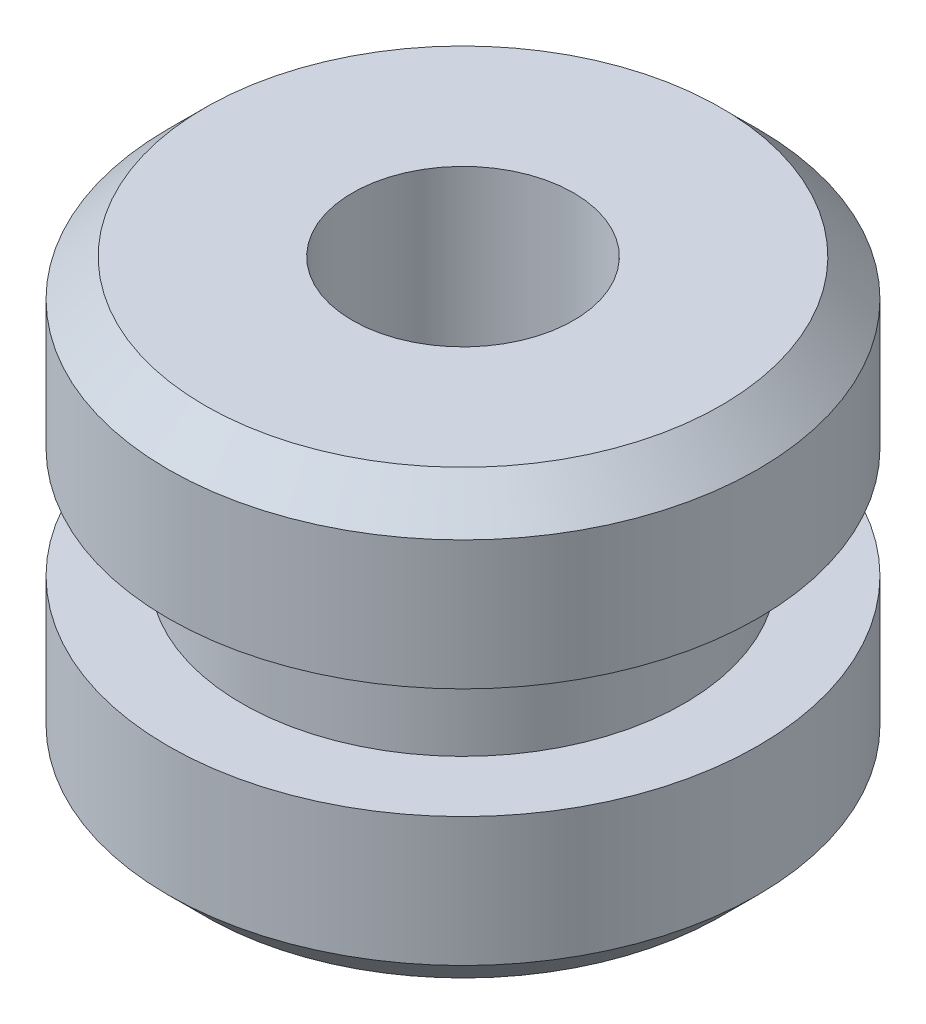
ISO-10303-21;
HEADER;
FILE_DESCRIPTION(('STEP AP214'),'2;1');
FILE_NAME('part.step','',(''),(''),'','','');
FILE_SCHEMA(('AUTOMOTIVE_DESIGN { 1 0 10303 214 1 1 1 1 }'));
ENDSEC;
DATA;
#1=APPLICATION_CONTEXT('core data for automotive mechanical design processes');
#2=APPLICATION_PROTOCOL_DEFINITION('international standard','automotive_design',2000,#1);
#3=PRODUCT_CONTEXT('',#1,'mechanical');
#4=PRODUCT('Part','Part','',(#3));
#5=PRODUCT_RELATED_PRODUCT_CATEGORY('part','',(#4));
#6=PRODUCT_DEFINITION_FORMATION('','',#4);
#7=PRODUCT_DEFINITION_CONTEXT('part definition',#1,'design');
#8=PRODUCT_DEFINITION('design','',#6,#7);
#9=PRODUCT_DEFINITION_SHAPE('','',#8);
#10=(LENGTH_UNIT() NAMED_UNIT(*) SI_UNIT(.MILLI.,.METRE.));
#11=(NAMED_UNIT(*) PLANE_ANGLE_UNIT() SI_UNIT($,.RADIAN.));
#12=(NAMED_UNIT(*) SI_UNIT($,.STERADIAN.) SOLID_ANGLE_UNIT());
#13=UNCERTAINTY_MEASURE_WITH_UNIT(LENGTH_MEASURE(1.E-05),#10,'distance_accuracy_value','');
#14=(GEOMETRIC_REPRESENTATION_CONTEXT(3) GLOBAL_UNCERTAINTY_ASSIGNED_CONTEXT((#13)) GLOBAL_UNIT_ASSIGNED_CONTEXT((#10,
#11,#12)) REPRESENTATION_CONTEXT('',''));
#15=CARTESIAN_POINT('',(0.,0.,0.));
#16=DIRECTION('',(0.,0.,1.));
#17=DIRECTION('',(1.,0.,0.));
#18=AXIS2_PLACEMENT_3D('',#15,#16,#17);
#19=CARTESIAN_POINT('',(1.5,6.,0.));
#20=DIRECTION('',(0.,1.,0.));
#21=DIRECTION('',(0.,0.,1.));
#22=AXIS2_PLACEMENT_3D('',#19,#20,#21);
#23=PLANE('',#22);
#24=CARTESIAN_POINT('',(0.,6.,0.));
#25=DIRECTION('',(0.,1.,0.));
#26=DIRECTION('',(0.,0.,1.));
#27=AXIS2_PLACEMENT_3D('',#24,#25,#26);
#28=CIRCLE('',#27,3.5);
#29=CARTESIAN_POINT('',(0.,6.,3.5));
#30=VERTEX_POINT('',#29);
#31=EDGE_CURVE('E39',#30,#30,#28,.T.);
#32=ORIENTED_EDGE('',*,*,#31,.T.);
#33=EDGE_LOOP('',(#32));
#34=FACE_BOUND('',#33,.T.);
#35=CARTESIAN_POINT('',(0.,6.,0.));
#36=DIRECTION('',(0.,-1.,0.));
#37=DIRECTION('',(0.,0.,-1.));
#38=AXIS2_PLACEMENT_3D('',#35,#36,#37);
#39=CIRCLE('',#38,1.5);
#40=CARTESIAN_POINT('',(0.,6.,-1.5));
#41=VERTEX_POINT('',#40);
#42=EDGE_CURVE('E63',#41,#41,#39,.T.);
#43=ORIENTED_EDGE('',*,*,#42,.T.);
#44=EDGE_LOOP('',(#43));
#45=FACE_BOUND('',#44,.T.);
#46=ADVANCED_FACE('F29',(#34,#45),#23,.T.);
#47=CARTESIAN_POINT('',(0.,-8.,0.));
#48=DIRECTION('',(0.,-1.,0.));
#49=DIRECTION('',(0.,0.,-1.));
#50=AXIS2_PLACEMENT_3D('',#47,#48,#49);
#51=CYLINDRICAL_SURFACE('',#50,4.);
#52=CARTESIAN_POINT('',(0.,5.49999999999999,0.));
#53=DIRECTION('',(0.,1.,0.));
#54=DIRECTION('',(0.,0.,1.));
#55=AXIS2_PLACEMENT_3D('',#52,#53,#54);
#56=CIRCLE('',#55,4.);
#57=CARTESIAN_POINT('',(0.,5.49999999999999,4.));
#58=VERTEX_POINT('',#57);
#59=EDGE_CURVE('E43',#58,#58,#56,.F.);
#60=ORIENTED_EDGE('',*,*,#59,.T.);
#61=EDGE_LOOP('',(#60));
#62=FACE_BOUND('',#61,.T.);
#63=CARTESIAN_POINT('',(0.,3.75,0.));
#64=DIRECTION('',(0.,-1.,0.));
#65=DIRECTION('',(0.,0.,-1.));
#66=AXIS2_PLACEMENT_3D('',#63,#64,#65);
#67=CIRCLE('',#66,4.);
#68=CARTESIAN_POINT('',(0.,3.75,-4.));
#69=VERTEX_POINT('',#68);
#70=EDGE_CURVE('E48',#69,#69,#67,.T.);
#71=ORIENTED_EDGE('',*,*,#70,.F.);
#72=EDGE_LOOP('',(#71));
#73=FACE_BOUND('',#72,.T.);
#74=ADVANCED_FACE('F84',(#62,#73),#51,.T.);
#75=CARTESIAN_POINT('',(4.,3.75,0.));
#76=DIRECTION('',(0.,-1.,0.));
#77=DIRECTION('',(0.,0.,-1.));
#78=AXIS2_PLACEMENT_3D('',#75,#76,#77);
#79=PLANE('',#78);
#80=ORIENTED_EDGE('',*,*,#70,.T.);
#81=EDGE_LOOP('',(#80));
#82=FACE_BOUND('',#81,.T.);
#83=CARTESIAN_POINT('',(0.,3.75,0.));
#84=DIRECTION('',(0.,-1.,0.));
#85=DIRECTION('',(0.,0.,-1.));
#86=AXIS2_PLACEMENT_3D('',#83,#84,#85);
#87=CIRCLE('',#86,3.);
#88=CARTESIAN_POINT('',(0.,3.75,-3.));
#89=VERTEX_POINT('',#88);
#90=EDGE_CURVE('E51',#89,#89,#87,.T.);
#91=ORIENTED_EDGE('',*,*,#90,.F.);
#92=EDGE_LOOP('',(#91));
#93=FACE_BOUND('',#92,.T.);
#94=ADVANCED_FACE('F89',(#82,#93),#79,.T.);
#95=CARTESIAN_POINT('',(0.,-8.,0.));
#96=DIRECTION('',(0.,-1.,0.));
#97=DIRECTION('',(0.,0.,-1.));
#98=AXIS2_PLACEMENT_3D('',#95,#96,#97);
#99=CYLINDRICAL_SURFACE('',#98,3.);
#100=ORIENTED_EDGE('',*,*,#90,.T.);
#101=EDGE_LOOP('',(#100));
#102=FACE_BOUND('',#101,.T.);
#103=CARTESIAN_POINT('',(0.,2.25,0.));
#104=DIRECTION('',(0.,-1.,0.));
#105=DIRECTION('',(0.,0.,-1.));
#106=AXIS2_PLACEMENT_3D('',#103,#104,#105);
#107=CIRCLE('',#106,3.);
#108=CARTESIAN_POINT('',(0.,2.25,-3.));
#109=VERTEX_POINT('',#108);
#110=EDGE_CURVE('E54',#109,#109,#107,.T.);
#111=ORIENTED_EDGE('',*,*,#110,.F.);
#112=EDGE_LOOP('',(#111));
#113=FACE_BOUND('',#112,.T.);
#114=ADVANCED_FACE('F99',(#102,#113),#99,.T.);
#115=CARTESIAN_POINT('',(3.,2.25,0.));
#116=DIRECTION('',(0.,1.,0.));
#117=DIRECTION('',(0.,0.,1.));
#118=AXIS2_PLACEMENT_3D('',#115,#116,#117);
#119=PLANE('',#118);
#120=ORIENTED_EDGE('',*,*,#110,.T.);
#121=EDGE_LOOP('',(#120));
#122=FACE_BOUND('',#121,.T.);
#123=CARTESIAN_POINT('',(0.,2.25,0.));
#124=DIRECTION('',(0.,-1.,0.));
#125=DIRECTION('',(0.,0.,-1.));
#126=AXIS2_PLACEMENT_3D('',#123,#124,#125);
#127=CIRCLE('',#126,4.);
#128=CARTESIAN_POINT('',(0.,2.25,-4.));
#129=VERTEX_POINT('',#128);
#130=EDGE_CURVE('E57',#129,#129,#127,.T.);
#131=ORIENTED_EDGE('',*,*,#130,.F.);
#132=EDGE_LOOP('',(#131));
#133=FACE_BOUND('',#132,.T.);
#134=ADVANCED_FACE('F105',(#122,#133),#119,.T.);
#135=CARTESIAN_POINT('',(0.,-8.,0.));
#136=DIRECTION('',(0.,-1.,0.));
#137=DIRECTION('',(0.,0.,-1.));
#138=AXIS2_PLACEMENT_3D('',#135,#136,#137);
#139=CYLINDRICAL_SURFACE('',#138,4.);
#140=CARTESIAN_POINT('',(0.,0.500000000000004,0.));
#141=DIRECTION('',(0.,-1.,0.));
#142=DIRECTION('',(0.,0.,-1.));
#143=AXIS2_PLACEMENT_3D('',#140,#141,#142);
#144=CIRCLE('',#143,4.);
#145=CARTESIAN_POINT('',(0.,0.500000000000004,-4.));
#146=VERTEX_POINT('',#145);
#147=EDGE_CURVE('E10',#146,#146,#144,.F.);
#148=ORIENTED_EDGE('',*,*,#147,.T.);
#149=EDGE_LOOP('',(#148));
#150=FACE_BOUND('',#149,.T.);
#151=ORIENTED_EDGE('',*,*,#130,.T.);
#152=EDGE_LOOP('',(#151));
#153=FACE_BOUND('',#152,.T.);
#154=ADVANCED_FACE('F81',(#150,#153),#139,.T.);
#155=CARTESIAN_POINT('',(4.,0.,0.));
#156=DIRECTION('',(0.,-1.,0.));
#157=DIRECTION('',(0.,0.,-1.));
#158=AXIS2_PLACEMENT_3D('',#155,#156,#157);
#159=PLANE('',#158);
#160=CARTESIAN_POINT('',(0.,0.,0.));
#161=DIRECTION('',(0.,-1.,0.));
#162=DIRECTION('',(0.,0.,-1.));
#163=AXIS2_PLACEMENT_3D('',#160,#161,#162);
#164=CIRCLE('',#163,3.49999999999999);
#165=CARTESIAN_POINT('',(0.,0.,-3.49999999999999));
#166=VERTEX_POINT('',#165);
#167=EDGE_CURVE('E35',#166,#166,#164,.T.);
#168=ORIENTED_EDGE('',*,*,#167,.T.);
#169=EDGE_LOOP('',(#168));
#170=FACE_BOUND('',#169,.T.);
#171=CARTESIAN_POINT('',(0.,0.,0.));
#172=DIRECTION('',(0.,-1.,0.));
#173=DIRECTION('',(0.,0.,-1.));
#174=AXIS2_PLACEMENT_3D('',#171,#172,#173);
#175=CIRCLE('',#174,1.5);
#176=CARTESIAN_POINT('',(0.,0.,-1.5));
#177=VERTEX_POINT('',#176);
#178=EDGE_CURVE('E60',#177,#177,#175,.T.);
#179=ORIENTED_EDGE('',*,*,#178,.F.);
#180=EDGE_LOOP('',(#179));
#181=FACE_BOUND('',#180,.T.);
#182=ADVANCED_FACE('F71',(#170,#181),#159,.T.);
#183=CARTESIAN_POINT('',(0.,-8.,0.));
#184=DIRECTION('',(0.,-1.,0.));
#185=DIRECTION('',(0.,0.,-1.));
#186=AXIS2_PLACEMENT_3D('',#183,#184,#185);
#187=CYLINDRICAL_SURFACE('',#186,1.5);
#188=ORIENTED_EDGE('',*,*,#178,.T.);
#189=EDGE_LOOP('',(#188));
#190=FACE_BOUND('',#189,.T.);
#191=ORIENTED_EDGE('',*,*,#42,.F.);
#192=EDGE_LOOP('',(#191));
#193=FACE_BOUND('',#192,.T.);
#194=ADVANCED_FACE('F68',(#190,#193),#187,.F.);
#195=CARTESIAN_POINT('',(0.,5.49999999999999,0.));
#196=DIRECTION('',(0.,-1.,0.));
#197=DIRECTION('',(0.,0.,-1.));
#198=AXIS2_PLACEMENT_3D('',#195,#196,#197);
#199=CONICAL_SURFACE('',#198,4.,0.785398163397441);
#200=ORIENTED_EDGE('',*,*,#31,.F.);
#201=EDGE_LOOP('',(#200));
#202=FACE_BOUND('',#201,.T.);
#203=ORIENTED_EDGE('',*,*,#59,.F.);
#204=EDGE_LOOP('',(#203));
#205=FACE_BOUND('',#204,.T.);
#206=ADVANCED_FACE('F70',(#202,#205),#199,.T.);
#207=CARTESIAN_POINT('',(0.,0.,0.));
#208=DIRECTION('',(0.,1.,0.));
#209=DIRECTION('',(0.,0.,1.));
#210=AXIS2_PLACEMENT_3D('',#207,#208,#209);
#211=CONICAL_SURFACE('',#210,3.49999999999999,0.785398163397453);
#212=ORIENTED_EDGE('',*,*,#147,.F.);
#213=EDGE_LOOP('',(#212));
#214=FACE_BOUND('',#213,.T.);
#215=ORIENTED_EDGE('',*,*,#167,.F.);
#216=EDGE_LOOP('',(#215));
#217=FACE_BOUND('',#216,.T.);
#218=ADVANCED_FACE('F78',(#214,#217),#211,.T.);
#219=CLOSED_SHELL('',(#46,#74,#94,#114,#134,#154,#182,#194,#206,#218));
#220=MANIFOLD_SOLID_BREP('B2',#219);
#221=ADVANCED_BREP_SHAPE_REPRESENTATION('',(#18,#220),#14);
#222=SHAPE_DEFINITION_REPRESENTATION(#9,#221);
ENDSEC;
END-ISO-10303-21;
